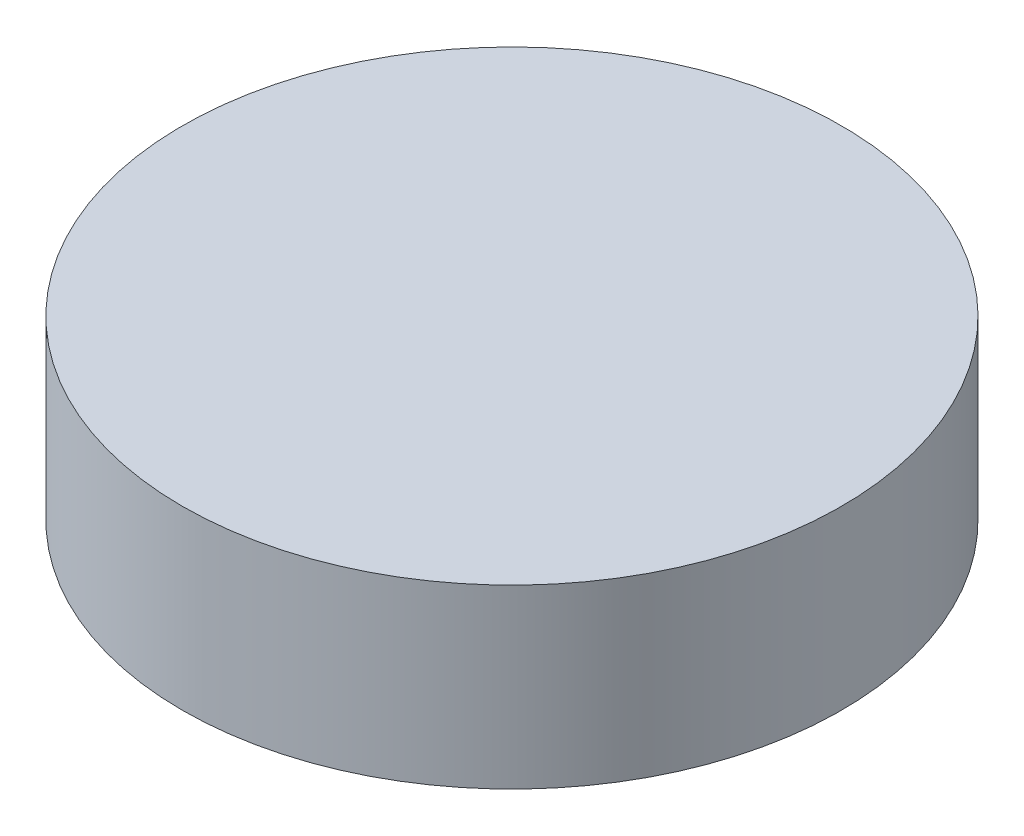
ISO-10303-21;
HEADER;
FILE_DESCRIPTION(('STEP AP214'),'2;1');
FILE_NAME('part.step','',(''),(''),'','','');
FILE_SCHEMA(('AUTOMOTIVE_DESIGN { 1 0 10303 214 1 1 1 1 }'));
ENDSEC;
DATA;
#1=APPLICATION_CONTEXT('core data for automotive mechanical design processes');
#2=APPLICATION_PROTOCOL_DEFINITION('international standard','automotive_design',2000,#1);
#3=PRODUCT_CONTEXT('',#1,'mechanical');
#4=PRODUCT('Part','Part','',(#3));
#5=PRODUCT_RELATED_PRODUCT_CATEGORY('part','',(#4));
#6=PRODUCT_DEFINITION_FORMATION('','',#4);
#7=PRODUCT_DEFINITION_CONTEXT('part definition',#1,'design');
#8=PRODUCT_DEFINITION('design','',#6,#7);
#9=PRODUCT_DEFINITION_SHAPE('','',#8);
#10=(LENGTH_UNIT() NAMED_UNIT(*) SI_UNIT(.MILLI.,.METRE.));
#11=(NAMED_UNIT(*) PLANE_ANGLE_UNIT() SI_UNIT($,.RADIAN.));
#12=(NAMED_UNIT(*) SI_UNIT($,.STERADIAN.) SOLID_ANGLE_UNIT());
#13=UNCERTAINTY_MEASURE_WITH_UNIT(LENGTH_MEASURE(1.E-05),#10,'distance_accuracy_value','');
#14=(GEOMETRIC_REPRESENTATION_CONTEXT(3) GLOBAL_UNCERTAINTY_ASSIGNED_CONTEXT((#13)) GLOBAL_UNIT_ASSIGNED_CONTEXT((#10,
#11,#12)) REPRESENTATION_CONTEXT('',''));
#15=CARTESIAN_POINT('',(0.,0.,0.));
#16=DIRECTION('',(0.,0.,1.));
#17=DIRECTION('',(1.,0.,0.));
#18=AXIS2_PLACEMENT_3D('',#15,#16,#17);
#19=CARTESIAN_POINT('',(0.,1.7018,0.));
#20=DIRECTION('',(0.,-1.,0.));
#21=DIRECTION('',(0.,0.,-1.));
#22=AXIS2_PLACEMENT_3D('',#19,#20,#21);
#23=CYLINDRICAL_SURFACE('',#22,3.175);
#24=CARTESIAN_POINT('',(0.,1.7018,0.));
#25=DIRECTION('',(0.,1.,0.));
#26=DIRECTION('',(0.,0.,1.));
#27=AXIS2_PLACEMENT_3D('',#24,#25,#26);
#28=CIRCLE('',#27,3.175);
#29=CARTESIAN_POINT('',(0.,1.7018,3.175));
#30=VERTEX_POINT('',#29);
#31=EDGE_CURVE('E10',#30,#30,#28,.T.);
#32=ORIENTED_EDGE('',*,*,#31,.F.);
#33=EDGE_LOOP('',(#32));
#34=FACE_BOUND('',#33,.T.);
#35=CARTESIAN_POINT('',(0.,0.,0.));
#36=DIRECTION('',(0.,1.,0.));
#37=DIRECTION('',(0.,0.,1.));
#38=AXIS2_PLACEMENT_3D('',#35,#36,#37);
#39=CIRCLE('',#38,3.175);
#40=CARTESIAN_POINT('',(0.,0.,3.175));
#41=VERTEX_POINT('',#40);
#42=EDGE_CURVE('E34',#41,#41,#39,.T.);
#43=ORIENTED_EDGE('',*,*,#42,.T.);
#44=EDGE_LOOP('',(#43));
#45=FACE_BOUND('',#44,.T.);
#46=ADVANCED_FACE('F31',(#34,#45),#23,.T.);
#47=CARTESIAN_POINT('',(0.,1.7018,0.));
#48=DIRECTION('',(0.,1.,0.));
#49=DIRECTION('',(0.,0.,1.));
#50=AXIS2_PLACEMENT_3D('',#47,#48,#49);
#51=PLANE('',#50);
#52=ORIENTED_EDGE('',*,*,#31,.T.);
#53=EDGE_LOOP('',(#52));
#54=FACE_BOUND('',#53,.T.);
#55=ADVANCED_FACE('F46',(#54),#51,.T.);
#56=CARTESIAN_POINT('',(0.,0.,0.));
#57=DIRECTION('',(0.,1.,0.));
#58=DIRECTION('',(0.,0.,1.));
#59=AXIS2_PLACEMENT_3D('',#56,#57,#58);
#60=PLANE('',#59);
#61=ORIENTED_EDGE('',*,*,#42,.F.);
#62=EDGE_LOOP('',(#61));
#63=FACE_BOUND('',#62,.T.);
#64=ADVANCED_FACE('F44',(#63),#60,.F.);
#65=CLOSED_SHELL('',(#46,#55,#64));
#66=MANIFOLD_SOLID_BREP('B2',#65);
#67=ADVANCED_BREP_SHAPE_REPRESENTATION('',(#18,#66),#14);
#68=SHAPE_DEFINITION_REPRESENTATION(#9,#67);
ENDSEC;
END-ISO-10303-21;
